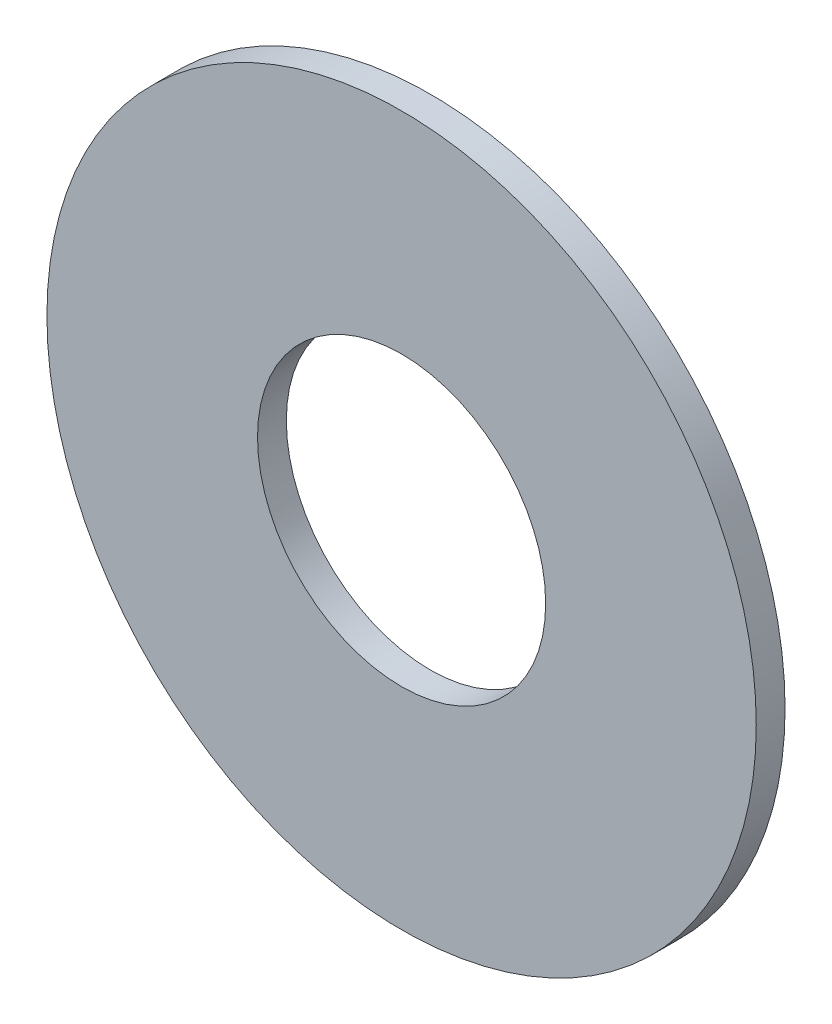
ISO-10303-21;
HEADER;
FILE_DESCRIPTION(('STEP AP214'),'2;1');
FILE_NAME('part.step','',(''),(''),'','','');
FILE_SCHEMA(('AUTOMOTIVE_DESIGN { 1 0 10303 214 1 1 1 1 }'));
ENDSEC;
DATA;
#1=APPLICATION_CONTEXT('core data for automotive mechanical design processes');
#2=APPLICATION_PROTOCOL_DEFINITION('international standard','automotive_design',2000,#1);
#3=PRODUCT_CONTEXT('',#1,'mechanical');
#4=PRODUCT('Part','Part','',(#3));
#5=PRODUCT_RELATED_PRODUCT_CATEGORY('part','',(#4));
#6=PRODUCT_DEFINITION_FORMATION('','',#4);
#7=PRODUCT_DEFINITION_CONTEXT('part definition',#1,'design');
#8=PRODUCT_DEFINITION('design','',#6,#7);
#9=PRODUCT_DEFINITION_SHAPE('','',#8);
#10=(LENGTH_UNIT() NAMED_UNIT(*) SI_UNIT(.MILLI.,.METRE.));
#11=(NAMED_UNIT(*) PLANE_ANGLE_UNIT() SI_UNIT($,.RADIAN.));
#12=(NAMED_UNIT(*) SI_UNIT($,.STERADIAN.) SOLID_ANGLE_UNIT());
#13=UNCERTAINTY_MEASURE_WITH_UNIT(LENGTH_MEASURE(1.E-05),#10,'distance_accuracy_value','');
#14=(GEOMETRIC_REPRESENTATION_CONTEXT(3) GLOBAL_UNCERTAINTY_ASSIGNED_CONTEXT((#13)) GLOBAL_UNIT_ASSIGNED_CONTEXT((#10,
#11,#12)) REPRESENTATION_CONTEXT('',''));
#15=CARTESIAN_POINT('',(0.,0.,0.));
#16=DIRECTION('',(0.,0.,1.));
#17=DIRECTION('',(1.,0.,0.));
#18=AXIS2_PLACEMENT_3D('',#15,#16,#17);
#19=CARTESIAN_POINT('',(0.,0.,1.3));
#20=DIRECTION('',(0.,0.,1.));
#21=DIRECTION('',(1.,0.,0.));
#22=AXIS2_PLACEMENT_3D('',#19,#20,#21);
#23=PLANE('',#22);
#24=CARTESIAN_POINT('',(0.,0.,1.3));
#25=DIRECTION('',(0.,0.,1.));
#26=DIRECTION('',(1.,0.,0.));
#27=AXIS2_PLACEMENT_3D('',#24,#25,#26);
#28=CIRCLE('',#27,16.);
#29=CARTESIAN_POINT('',(16.,0.,1.3));
#30=VERTEX_POINT('',#29);
#31=EDGE_CURVE('E10',#30,#30,#28,.T.);
#32=ORIENTED_EDGE('',*,*,#31,.T.);
#33=EDGE_LOOP('',(#32));
#34=FACE_BOUND('',#33,.T.);
#35=CARTESIAN_POINT('',(0.,0.,1.3));
#36=DIRECTION('',(0.,0.,1.));
#37=DIRECTION('',(1.,0.,0.));
#38=AXIS2_PLACEMENT_3D('',#35,#36,#37);
#39=CIRCLE('',#38,6.5);
#40=CARTESIAN_POINT('',(6.5,0.,1.3));
#41=VERTEX_POINT('',#40);
#42=EDGE_CURVE('E45',#41,#41,#39,.T.);
#43=ORIENTED_EDGE('',*,*,#42,.F.);
#44=EDGE_LOOP('',(#43));
#45=FACE_BOUND('',#44,.T.);
#46=ADVANCED_FACE('F34',(#34,#45),#23,.T.);
#47=CARTESIAN_POINT('',(0.,0.,0.));
#48=DIRECTION('',(0.,0.,1.));
#49=DIRECTION('',(1.,0.,0.));
#50=AXIS2_PLACEMENT_3D('',#47,#48,#49);
#51=PLANE('',#50);
#52=CARTESIAN_POINT('',(0.,0.,0.));
#53=DIRECTION('',(0.,0.,1.));
#54=DIRECTION('',(1.,0.,0.));
#55=AXIS2_PLACEMENT_3D('',#52,#53,#54);
#56=CIRCLE('',#55,16.);
#57=CARTESIAN_POINT('',(16.,0.,0.));
#58=VERTEX_POINT('',#57);
#59=EDGE_CURVE('E41',#58,#58,#56,.T.);
#60=ORIENTED_EDGE('',*,*,#59,.F.);
#61=EDGE_LOOP('',(#60));
#62=FACE_BOUND('',#61,.T.);
#63=CARTESIAN_POINT('',(0.,0.,0.));
#64=DIRECTION('',(0.,0.,1.));
#65=DIRECTION('',(1.,0.,0.));
#66=AXIS2_PLACEMENT_3D('',#63,#64,#65);
#67=CIRCLE('',#66,6.5);
#68=CARTESIAN_POINT('',(6.5,0.,0.));
#69=VERTEX_POINT('',#68);
#70=EDGE_CURVE('E49',#69,#69,#67,.T.);
#71=ORIENTED_EDGE('',*,*,#70,.T.);
#72=EDGE_LOOP('',(#71));
#73=FACE_BOUND('',#72,.T.);
#74=ADVANCED_FACE('F55',(#62,#73),#51,.F.);
#75=CARTESIAN_POINT('',(0.,0.,1.3));
#76=DIRECTION('',(0.,0.,-1.));
#77=DIRECTION('',(-1.,0.,0.));
#78=AXIS2_PLACEMENT_3D('',#75,#76,#77);
#79=CYLINDRICAL_SURFACE('',#78,16.);
#80=ORIENTED_EDGE('',*,*,#31,.F.);
#81=EDGE_LOOP('',(#80));
#82=FACE_BOUND('',#81,.T.);
#83=ORIENTED_EDGE('',*,*,#59,.T.);
#84=EDGE_LOOP('',(#83));
#85=FACE_BOUND('',#84,.T.);
#86=ADVANCED_FACE('F36',(#82,#85),#79,.T.);
#87=CARTESIAN_POINT('',(0.,0.,1.3));
#88=DIRECTION('',(0.,0.,-1.));
#89=DIRECTION('',(-1.,0.,0.));
#90=AXIS2_PLACEMENT_3D('',#87,#88,#89);
#91=CYLINDRICAL_SURFACE('',#90,6.5);
#92=ORIENTED_EDGE('',*,*,#42,.T.);
#93=EDGE_LOOP('',(#92));
#94=FACE_BOUND('',#93,.T.);
#95=ORIENTED_EDGE('',*,*,#70,.F.);
#96=EDGE_LOOP('',(#95));
#97=FACE_BOUND('',#96,.T.);
#98=ADVANCED_FACE('F57',(#94,#97),#91,.F.);
#99=CLOSED_SHELL('',(#46,#74,#86,#98));
#100=MANIFOLD_SOLID_BREP('B2',#99);
#101=ADVANCED_BREP_SHAPE_REPRESENTATION('',(#18,#100),#14);
#102=SHAPE_DEFINITION_REPRESENTATION(#9,#101);
ENDSEC;
END-ISO-10303-21;
